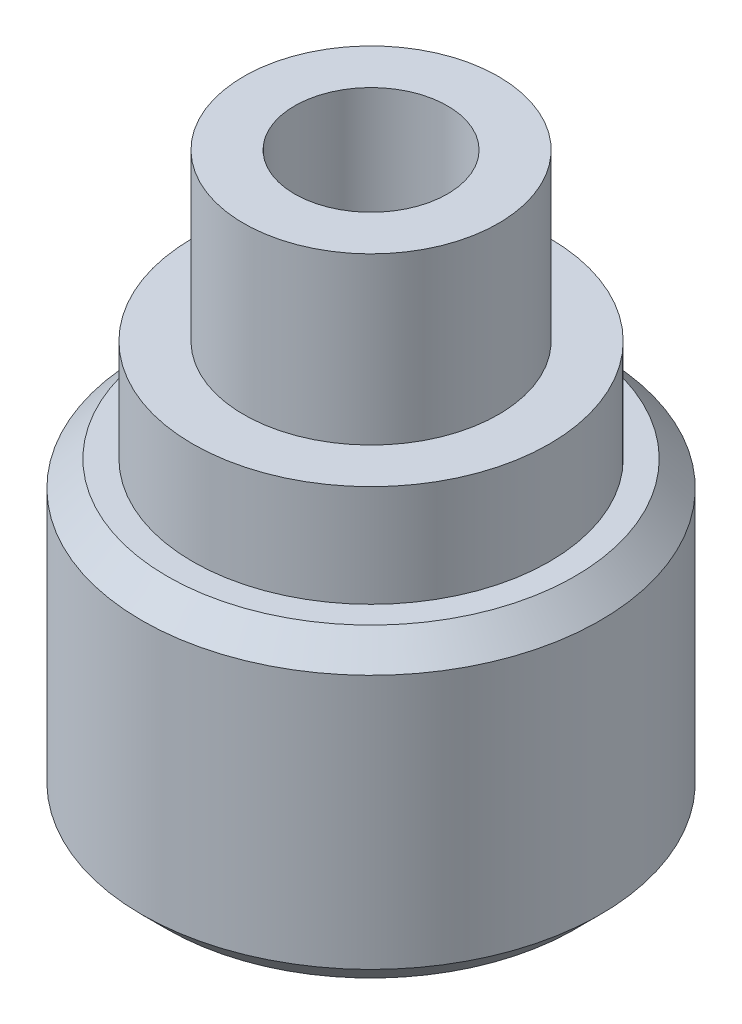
ISO-10303-21;
HEADER;
FILE_DESCRIPTION(('STEP AP214'),'2;1');
FILE_NAME('part.step','',(''),(''),'','','');
FILE_SCHEMA(('AUTOMOTIVE_DESIGN { 1 0 10303 214 1 1 1 1 }'));
ENDSEC;
DATA;
#1=APPLICATION_CONTEXT('core data for automotive mechanical design processes');
#2=APPLICATION_PROTOCOL_DEFINITION('international standard','automotive_design',2000,#1);
#3=PRODUCT_CONTEXT('',#1,'mechanical');
#4=PRODUCT('Part','Part','',(#3));
#5=PRODUCT_RELATED_PRODUCT_CATEGORY('part','',(#4));
#6=PRODUCT_DEFINITION_FORMATION('','',#4);
#7=PRODUCT_DEFINITION_CONTEXT('part definition',#1,'design');
#8=PRODUCT_DEFINITION('design','',#6,#7);
#9=PRODUCT_DEFINITION_SHAPE('','',#8);
#10=(LENGTH_UNIT() NAMED_UNIT(*) SI_UNIT(.MILLI.,.METRE.));
#11=(NAMED_UNIT(*) PLANE_ANGLE_UNIT() SI_UNIT($,.RADIAN.));
#12=(NAMED_UNIT(*) SI_UNIT($,.STERADIAN.) SOLID_ANGLE_UNIT());
#13=UNCERTAINTY_MEASURE_WITH_UNIT(LENGTH_MEASURE(1.E-05),#10,'distance_accuracy_value','');
#14=(GEOMETRIC_REPRESENTATION_CONTEXT(3) GLOBAL_UNCERTAINTY_ASSIGNED_CONTEXT((#13)) GLOBAL_UNIT_ASSIGNED_CONTEXT((#10,
#11,#12)) REPRESENTATION_CONTEXT('',''));
#15=CARTESIAN_POINT('',(0.,0.,0.));
#16=DIRECTION('',(0.,0.,1.));
#17=DIRECTION('',(1.,0.,0.));
#18=AXIS2_PLACEMENT_3D('',#15,#16,#17);
#19=CARTESIAN_POINT('',(0.,16.,0.));
#20=DIRECTION('',(0.,1.,0.));
#21=DIRECTION('',(0.,0.,1.));
#22=AXIS2_PLACEMENT_3D('',#19,#20,#21);
#23=PLANE('',#22);
#24=CARTESIAN_POINT('',(0.,16.,0.));
#25=DIRECTION('',(0.,1.,0.));
#26=DIRECTION('',(0.,0.,1.));
#27=AXIS2_PLACEMENT_3D('',#24,#25,#26);
#28=CIRCLE('',#27,7.);
#29=CARTESIAN_POINT('',(0.,16.,7.));
#30=VERTEX_POINT('',#29);
#31=EDGE_CURVE('E51',#30,#30,#28,.T.);
#32=ORIENTED_EDGE('',*,*,#31,.T.);
#33=EDGE_LOOP('',(#32));
#34=FACE_BOUND('',#33,.T.);
#35=CARTESIAN_POINT('',(0.,16.,0.));
#36=DIRECTION('',(0.,1.,0.));
#37=DIRECTION('',(0.,0.,1.));
#38=AXIS2_PLACEMENT_3D('',#35,#36,#37);
#39=CIRCLE('',#38,5.);
#40=CARTESIAN_POINT('',(0.,16.,-5.));
#41=VERTEX_POINT('',#40);
#42=EDGE_CURVE('E58',#41,#41,#39,.T.);
#43=ORIENTED_EDGE('',*,*,#42,.F.);
#44=EDGE_LOOP('',(#43));
#45=FACE_BOUND('',#44,.T.);
#46=ADVANCED_FACE('F31',(#34,#45),#23,.T.);
#47=CARTESIAN_POINT('',(0.,12.,0.));
#48=DIRECTION('',(0.,1.,0.));
#49=DIRECTION('',(0.,0.,1.));
#50=AXIS2_PLACEMENT_3D('',#47,#48,#49);
#51=PLANE('',#50);
#52=CARTESIAN_POINT('',(0.,12.,0.));
#53=DIRECTION('',(0.,1.,0.));
#54=DIRECTION('',(0.,0.,1.));
#55=AXIS2_PLACEMENT_3D('',#52,#53,#54);
#56=CIRCLE('',#55,8.);
#57=CARTESIAN_POINT('',(0.,12.,8.));
#58=VERTEX_POINT('',#57);
#59=EDGE_CURVE('E10',#58,#58,#56,.T.);
#60=ORIENTED_EDGE('',*,*,#59,.T.);
#61=EDGE_LOOP('',(#60));
#62=FACE_BOUND('',#61,.T.);
#63=CARTESIAN_POINT('',(0.,12.,0.));
#64=DIRECTION('',(0.,1.,0.));
#65=DIRECTION('',(0.,0.,1.));
#66=AXIS2_PLACEMENT_3D('',#63,#64,#65);
#67=CIRCLE('',#66,7.);
#68=CARTESIAN_POINT('',(0.,12.,7.));
#69=VERTEX_POINT('',#68);
#70=EDGE_CURVE('E52',#69,#69,#67,.T.);
#71=ORIENTED_EDGE('',*,*,#70,.F.);
#72=EDGE_LOOP('',(#71));
#73=FACE_BOUND('',#72,.T.);
#74=ADVANCED_FACE('F93',(#62,#73),#51,.T.);
#75=CARTESIAN_POINT('',(0.,12.,0.));
#76=DIRECTION('',(0.,-1.,0.));
#77=DIRECTION('',(0.,0.,-1.));
#78=AXIS2_PLACEMENT_3D('',#75,#76,#77);
#79=CYLINDRICAL_SURFACE('',#78,9.);
#80=CARTESIAN_POINT('',(0.,0.999999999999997,0.));
#81=DIRECTION('',(0.,1.,0.));
#82=DIRECTION('',(0.,0.,1.));
#83=AXIS2_PLACEMENT_3D('',#80,#81,#82);
#84=CIRCLE('',#83,9.);
#85=CARTESIAN_POINT('',(0.,0.999999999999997,9.));
#86=VERTEX_POINT('',#85);
#87=EDGE_CURVE('E42',#86,#86,#84,.T.);
#88=ORIENTED_EDGE('',*,*,#87,.T.);
#89=EDGE_LOOP('',(#88));
#90=FACE_BOUND('',#89,.T.);
#91=CARTESIAN_POINT('',(0.,11.,0.));
#92=DIRECTION('',(0.,1.,0.));
#93=DIRECTION('',(0.,0.,1.));
#94=AXIS2_PLACEMENT_3D('',#91,#92,#93);
#95=CIRCLE('',#94,9.);
#96=CARTESIAN_POINT('',(0.,11.,9.));
#97=VERTEX_POINT('',#96);
#98=EDGE_CURVE('E46',#97,#97,#95,.F.);
#99=ORIENTED_EDGE('',*,*,#98,.T.);
#100=EDGE_LOOP('',(#99));
#101=FACE_BOUND('',#100,.T.);
#102=ADVANCED_FACE('F99',(#90,#101),#79,.T.);
#103=CARTESIAN_POINT('',(0.,0.,0.));
#104=DIRECTION('',(0.,1.,0.));
#105=DIRECTION('',(0.,0.,1.));
#106=AXIS2_PLACEMENT_3D('',#103,#104,#105);
#107=PLANE('',#106);
#108=CARTESIAN_POINT('',(0.,0.,0.));
#109=DIRECTION('',(0.,1.,0.));
#110=DIRECTION('',(0.,0.,1.));
#111=AXIS2_PLACEMENT_3D('',#108,#109,#110);
#112=CIRCLE('',#111,8.);
#113=CARTESIAN_POINT('',(0.,0.,8.));
#114=VERTEX_POINT('',#113);
#115=EDGE_CURVE('E38',#114,#114,#112,.F.);
#116=ORIENTED_EDGE('',*,*,#115,.T.);
#117=EDGE_LOOP('',(#116));
#118=FACE_BOUND('',#117,.T.);
#119=CARTESIAN_POINT('',(0.,0.,0.));
#120=DIRECTION('',(0.,1.,0.));
#121=DIRECTION('',(0.,0.,1.));
#122=AXIS2_PLACEMENT_3D('',#119,#120,#121);
#123=CIRCLE('',#122,2.49999999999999);
#124=CARTESIAN_POINT('',(0.,0.,2.49999999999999));
#125=VERTEX_POINT('',#124);
#126=EDGE_CURVE('E61',#125,#125,#123,.T.);
#127=ORIENTED_EDGE('',*,*,#126,.T.);
#128=EDGE_LOOP('',(#127));
#129=FACE_BOUND('',#128,.T.);
#130=ADVANCED_FACE('F103',(#118,#129),#107,.F.);
#131=CARTESIAN_POINT('',(0.,16.,0.));
#132=DIRECTION('',(0.,-1.,0.));
#133=DIRECTION('',(0.,0.,-1.));
#134=AXIS2_PLACEMENT_3D('',#131,#132,#133);
#135=CYLINDRICAL_SURFACE('',#134,7.);
#136=ORIENTED_EDGE('',*,*,#31,.F.);
#137=EDGE_LOOP('',(#136));
#138=FACE_BOUND('',#137,.T.);
#139=ORIENTED_EDGE('',*,*,#70,.T.);
#140=EDGE_LOOP('',(#139));
#141=FACE_BOUND('',#140,.T.);
#142=ADVANCED_FACE('F88',(#138,#141),#135,.T.);
#143=CARTESIAN_POINT('',(0.,22.5,0.));
#144=DIRECTION('',(0.,-1.,0.));
#145=DIRECTION('',(0.,0.,-1.));
#146=AXIS2_PLACEMENT_3D('',#143,#144,#145);
#147=CYLINDRICAL_SURFACE('',#146,5.);
#148=CARTESIAN_POINT('',(0.,22.5,0.));
#149=DIRECTION('',(0.,1.,0.));
#150=DIRECTION('',(0.,0.,1.));
#151=AXIS2_PLACEMENT_3D('',#148,#149,#150);
#152=CIRCLE('',#151,5.);
#153=CARTESIAN_POINT('',(0.,22.5,-5.));
#154=VERTEX_POINT('',#153);
#155=EDGE_CURVE('E55',#154,#154,#152,.T.);
#156=CARTESIAN_POINT('',(0.,22.5,-5.));
#157=CARTESIAN_POINT('',(0.,22.4322916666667,-5.));
#158=CARTESIAN_POINT('',(0.,22.3645833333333,-5.));
#159=CARTESIAN_POINT('',(0.,22.2291666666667,-5.));
#160=CARTESIAN_POINT('',(0.,22.1614583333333,-5.));
#161=CARTESIAN_POINT('',(0.,22.0260416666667,-5.));
#162=CARTESIAN_POINT('',(0.,21.9583333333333,-5.));
#163=CARTESIAN_POINT('',(0.,21.8229166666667,-5.));
#164=CARTESIAN_POINT('',(0.,21.7552083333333,-5.));
#165=CARTESIAN_POINT('',(0.,21.6197916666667,-5.));
#166=CARTESIAN_POINT('',(0.,21.5520833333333,-5.));
#167=CARTESIAN_POINT('',(0.,21.4166666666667,-5.));
#168=CARTESIAN_POINT('',(0.,21.3489583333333,-5.));
#169=CARTESIAN_POINT('',(0.,21.2135416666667,-5.));
#170=CARTESIAN_POINT('',(0.,21.1458333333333,-5.));
#171=CARTESIAN_POINT('',(0.,21.0104166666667,-5.));
#172=CARTESIAN_POINT('',(0.,20.9427083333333,-5.));
#173=CARTESIAN_POINT('',(0.,20.8072916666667,-5.));
#174=CARTESIAN_POINT('',(0.,20.7395833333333,-5.));
#175=CARTESIAN_POINT('',(0.,20.6041666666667,-5.));
#176=CARTESIAN_POINT('',(0.,20.5364583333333,-5.));
#177=CARTESIAN_POINT('',(0.,20.4010416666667,-5.));
#178=CARTESIAN_POINT('',(0.,20.3333333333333,-5.));
#179=CARTESIAN_POINT('',(0.,20.1979166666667,-5.));
#180=CARTESIAN_POINT('',(0.,20.1302083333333,-5.));
#181=CARTESIAN_POINT('',(0.,19.9947916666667,-5.));
#182=CARTESIAN_POINT('',(0.,19.9270833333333,-5.));
#183=CARTESIAN_POINT('',(0.,19.7916666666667,-5.));
#184=CARTESIAN_POINT('',(0.,19.7239583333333,-5.));
#185=CARTESIAN_POINT('',(0.,19.5885416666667,-5.));
#186=CARTESIAN_POINT('',(0.,19.5208333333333,-5.));
#187=CARTESIAN_POINT('',(0.,19.3854166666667,-5.));
#188=CARTESIAN_POINT('',(0.,19.3177083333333,-5.));
#189=CARTESIAN_POINT('',(0.,19.1822916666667,-5.));
#190=CARTESIAN_POINT('',(0.,19.1145833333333,-5.));
#191=CARTESIAN_POINT('',(0.,18.9791666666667,-5.));
#192=CARTESIAN_POINT('',(0.,18.9114583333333,-5.));
#193=CARTESIAN_POINT('',(0.,18.7760416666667,-5.));
#194=CARTESIAN_POINT('',(0.,18.7083333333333,-5.));
#195=CARTESIAN_POINT('',(0.,18.5729166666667,-5.));
#196=CARTESIAN_POINT('',(0.,18.5052083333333,-5.));
#197=CARTESIAN_POINT('',(0.,18.3697916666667,-5.));
#198=CARTESIAN_POINT('',(0.,18.3020833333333,-5.));
#199=CARTESIAN_POINT('',(0.,18.1666666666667,-5.));
#200=CARTESIAN_POINT('',(0.,18.0989583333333,-5.));
#201=CARTESIAN_POINT('',(0.,17.9635416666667,-5.));
#202=CARTESIAN_POINT('',(0.,17.8958333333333,-5.));
#203=CARTESIAN_POINT('',(0.,17.7604166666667,-5.));
#204=CARTESIAN_POINT('',(0.,17.6927083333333,-5.));
#205=CARTESIAN_POINT('',(0.,17.5572916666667,-5.));
#206=CARTESIAN_POINT('',(0.,17.4895833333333,-5.));
#207=CARTESIAN_POINT('',(0.,17.3541666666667,-5.));
#208=CARTESIAN_POINT('',(0.,17.2864583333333,-5.));
#209=CARTESIAN_POINT('',(0.,17.1510416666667,-5.));
#210=CARTESIAN_POINT('',(0.,17.0833333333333,-5.));
#211=CARTESIAN_POINT('',(0.,16.9479166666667,-5.));
#212=CARTESIAN_POINT('',(0.,16.8802083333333,-5.));
#213=CARTESIAN_POINT('',(0.,16.7447916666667,-5.));
#214=CARTESIAN_POINT('',(0.,16.6770833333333,-5.));
#215=CARTESIAN_POINT('',(0.,16.5416666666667,-5.));
#216=CARTESIAN_POINT('',(0.,16.4739583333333,-5.));
#217=CARTESIAN_POINT('',(0.,16.3385416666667,-5.));
#218=CARTESIAN_POINT('',(0.,16.2708333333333,-5.));
#219=CARTESIAN_POINT('',(0.,16.1354166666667,-5.));
#220=CARTESIAN_POINT('',(0.,16.0677083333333,-5.));
#221=CARTESIAN_POINT('',(0.,16.,-5.));
#222=B_SPLINE_CURVE_WITH_KNOTS('',3,(#156,#157,#158,#159,#160,#161,#162,#163,#164,#165,#166,
#167,#168,#169,#170,#171,#172,#173,#174,#175,#176,#177,#178,#179,#180,#181,#182,#183,#184,#185,
#186,#187,#188,#189,#190,#191,#192,#193,#194,#195,#196,#197,#198,#199,#200,#201,#202,#203,#204,
#205,#206,#207,#208,#209,#210,#211,#212,#213,#214,#215,#216,#217,#218,#219,#220,#221),
.UNSPECIFIED.,.F.,.F.,(4,2,2,2,2,2,2,2,2,2,2,2,2,2,2,2,2,2,2,2,2,2,2,2,2,2,2,2,2,2,2,2,4),(0.,
0.203125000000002,0.40625,0.609375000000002,0.812500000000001,1.015625,1.21875,1.421875,1.625,
1.828125,2.03125,2.234375,2.4375,2.640625,2.84375,3.046875,3.25,3.453125,3.65625,3.859375,
4.0625,4.265625,4.46875,4.671875,4.875,5.078125,5.28125,5.484375,5.6875,5.890625,6.09375,
6.296875,6.5),.UNSPECIFIED.);
#223=EDGE_CURVE('BSEAM82',#154,#41,#222,.T.);
#224=ORIENTED_EDGE('',*,*,#155,.F.);
#225=ORIENTED_EDGE('',*,*,#42,.T.);
#226=ORIENTED_EDGE('',*,*,#223,.T.);
#227=ORIENTED_EDGE('',*,*,#223,.F.);
#228=EDGE_LOOP('',(#224,#226,#225,#227));
#229=FACE_BOUND('',#228,.T.);
#230=ADVANCED_FACE('F82',(#229),#147,.T.);
#231=CARTESIAN_POINT('',(0.,22.5,0.));
#232=DIRECTION('',(0.,1.,0.));
#233=DIRECTION('',(0.,0.,1.));
#234=AXIS2_PLACEMENT_3D('',#231,#232,#233);
#235=PLANE('',#234);
#236=CARTESIAN_POINT('',(0.,22.5,0.));
#237=DIRECTION('',(0.,1.,0.));
#238=DIRECTION('',(0.,0.,1.));
#239=AXIS2_PLACEMENT_3D('',#236,#237,#238);
#240=CIRCLE('',#239,3.);
#241=CARTESIAN_POINT('',(0.,22.5,3.));
#242=VERTEX_POINT('',#241);
#243=EDGE_CURVE('E72',#242,#242,#240,.T.);
#244=ORIENTED_EDGE('',*,*,#243,.F.);
#245=EDGE_LOOP('',(#244));
#246=FACE_BOUND('',#245,.T.);
#247=ORIENTED_EDGE('',*,*,#155,.T.);
#248=EDGE_LOOP('',(#247));
#249=FACE_BOUND('',#248,.T.);
#250=ADVANCED_FACE('F78',(#246,#249),#235,.T.);
#251=CARTESIAN_POINT('',(0.,22.5,0.));
#252=DIRECTION('',(0.,1.,0.));
#253=DIRECTION('',(0.,0.,1.));
#254=AXIS2_PLACEMENT_3D('',#251,#252,#253);
#255=CYLINDRICAL_SURFACE('',#254,2.5);
#256=ORIENTED_EDGE('',*,*,#126,.F.);
#257=EDGE_LOOP('',(#256));
#258=FACE_BOUND('',#257,.T.);
#259=CARTESIAN_POINT('',(0.,11.,0.));
#260=DIRECTION('',(0.,1.,0.));
#261=DIRECTION('',(0.,0.,1.));
#262=AXIS2_PLACEMENT_3D('',#259,#260,#261);
#263=CIRCLE('',#262,2.5);
#264=CARTESIAN_POINT('',(0.,11.,2.5));
#265=VERTEX_POINT('',#264);
#266=EDGE_CURVE('E66',#265,#265,#263,.T.);
#267=ORIENTED_EDGE('',*,*,#266,.T.);
#268=EDGE_LOOP('',(#267));
#269=FACE_BOUND('',#268,.T.);
#270=ADVANCED_FACE('F81',(#258,#269),#255,.F.);
#271=CARTESIAN_POINT('',(2.5,11.,0.));
#272=DIRECTION('',(0.,-1.,0.));
#273=DIRECTION('',(0.,0.,-1.));
#274=AXIS2_PLACEMENT_3D('',#271,#272,#273);
#275=PLANE('',#274);
#276=ORIENTED_EDGE('',*,*,#266,.F.);
#277=EDGE_LOOP('',(#276));
#278=FACE_BOUND('',#277,.T.);
#279=CARTESIAN_POINT('',(0.,11.,0.));
#280=DIRECTION('',(0.,1.,0.));
#281=DIRECTION('',(0.,0.,1.));
#282=AXIS2_PLACEMENT_3D('',#279,#280,#281);
#283=CIRCLE('',#282,3.);
#284=CARTESIAN_POINT('',(0.,11.,3.));
#285=VERTEX_POINT('',#284);
#286=EDGE_CURVE('E69',#285,#285,#283,.T.);
#287=ORIENTED_EDGE('',*,*,#286,.T.);
#288=EDGE_LOOP('',(#287));
#289=FACE_BOUND('',#288,.T.);
#290=ADVANCED_FACE('F118',(#278,#289),#275,.F.);
#291=CARTESIAN_POINT('',(0.,22.5,0.));
#292=DIRECTION('',(0.,1.,0.));
#293=DIRECTION('',(0.,0.,1.));
#294=AXIS2_PLACEMENT_3D('',#291,#292,#293);
#295=CYLINDRICAL_SURFACE('',#294,3.);
#296=ORIENTED_EDGE('',*,*,#286,.F.);
#297=EDGE_LOOP('',(#296));
#298=FACE_BOUND('',#297,.T.);
#299=ORIENTED_EDGE('',*,*,#243,.T.);
#300=EDGE_LOOP('',(#299));
#301=FACE_BOUND('',#300,.T.);
#302=ADVANCED_FACE('F76',(#298,#301),#295,.F.);
#303=CARTESIAN_POINT('',(0.,0.999999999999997,0.));
#304=DIRECTION('',(0.,1.,0.));
#305=DIRECTION('',(0.,0.,1.));
#306=AXIS2_PLACEMENT_3D('',#303,#304,#305);
#307=CONICAL_SURFACE('',#306,9.,0.785398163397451);
#308=ORIENTED_EDGE('',*,*,#115,.F.);
#309=EDGE_LOOP('',(#308));
#310=FACE_BOUND('',#309,.T.);
#311=ORIENTED_EDGE('',*,*,#87,.F.);
#312=EDGE_LOOP('',(#311));
#313=FACE_BOUND('',#312,.T.);
#314=ADVANCED_FACE('F110',(#310,#313),#307,.T.);
#315=CARTESIAN_POINT('',(0.,12.,0.));
#316=DIRECTION('',(0.,-1.,0.));
#317=DIRECTION('',(0.,0.,-1.));
#318=AXIS2_PLACEMENT_3D('',#315,#316,#317);
#319=CONICAL_SURFACE('',#318,8.,0.785398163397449);
#320=ORIENTED_EDGE('',*,*,#98,.F.);
#321=EDGE_LOOP('',(#320));
#322=FACE_BOUND('',#321,.T.);
#323=ORIENTED_EDGE('',*,*,#59,.F.);
#324=EDGE_LOOP('',(#323));
#325=FACE_BOUND('',#324,.T.);
#326=ADVANCED_FACE('F33',(#322,#325),#319,.T.);
#327=CLOSED_SHELL('',(#46,#74,#102,#130,#142,#230,#250,#270,#290,#302,#314,#326));
#328=MANIFOLD_SOLID_BREP('B2',#327);
#329=ADVANCED_BREP_SHAPE_REPRESENTATION('',(#18,#328),#14);
#330=SHAPE_DEFINITION_REPRESENTATION(#9,#329);
ENDSEC;
END-ISO-10303-21;
